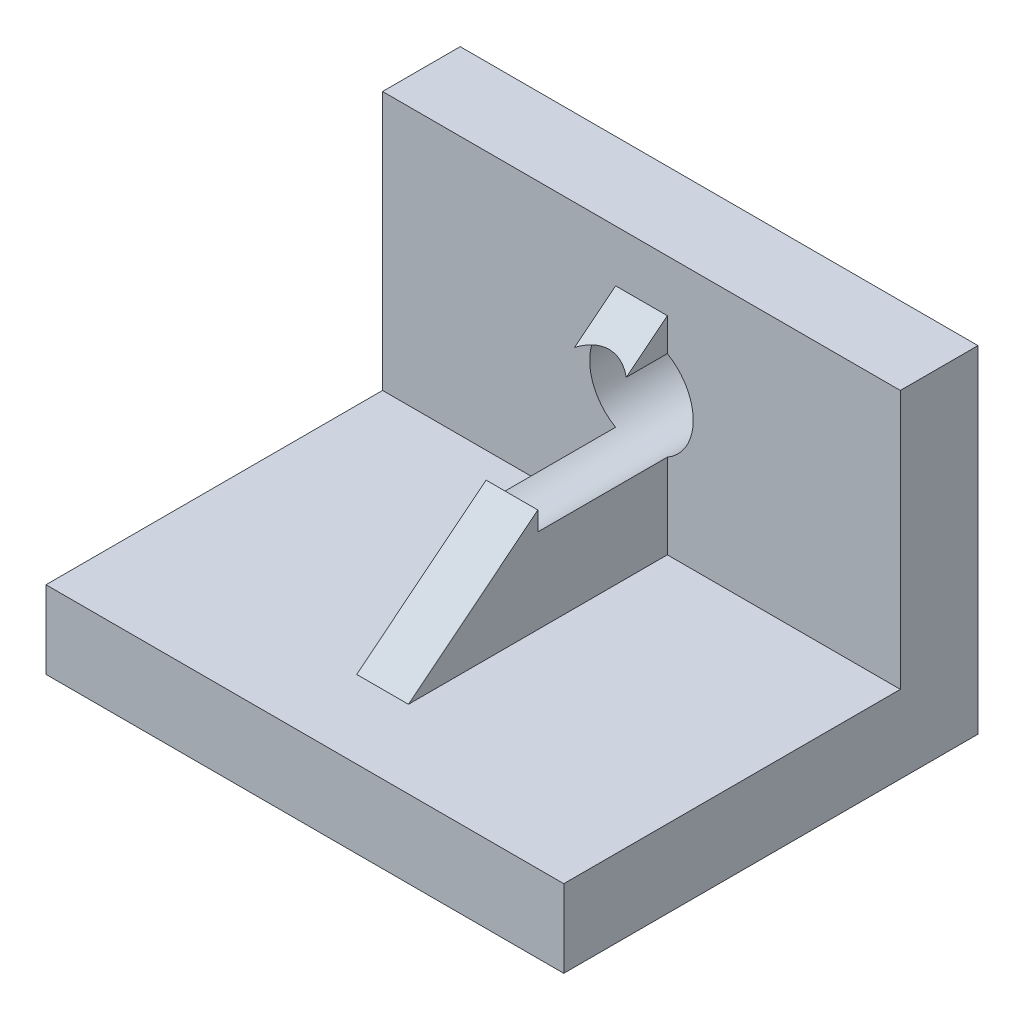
from build123d import *

# Parameters (mm, degrees)
SKETCH_1_W          = 100
SKETCH_1_H          = 80
EXTRUDE_1_DEPTH     = 15
SKETCH_2_W          = 100
SKETCH_2_H          = 15
EXTRUDE_2_DEPTH     = 50
EXTRUDE_3_DEPTH     = 5
SKETCH_4_R          = 10
CUT_EXTRUDE_1_DEPTH = 50


with BuildPart() as part:
    # Sketch 1 → Extrude 1 (new body)
    with BuildSketch(Plane(origin=(0, 0, 0), x_dir=(1, 0, 0), z_dir=(0, 1, 0))):
        Rectangle(SKETCH_1_W, SKETCH_1_H)
    extrude(amount=EXTRUDE_1_DEPTH)

    # Sketch 2 → Extrude 2 (add)
    with BuildSketch(Plane(origin=(0, 15, 0), x_dir=(1, 0, 0), z_dir=(0, 1, 0))):
        with Locations((0, 32.5)):
            Rectangle(SKETCH_2_W, SKETCH_2_H)
    extrude(amount=EXTRUDE_2_DEPTH)

    # Sketch 3 → Extrude 3 (add, symmetric)
    with BuildSketch(Plane(origin=(0, 0, 0), x_dir=(0, 0, -1), z_dir=(1, 0, 0))):
        Polygon((25, 15), (-25, 15), (25, 55), align=None)
    extrude(amount=EXTRUDE_3_DEPTH, both=True)

    # Sketch 4 → Cut-Extrude 1 (cut)
    with BuildSketch(Plane.XY):
        with Locations((0, 40)):
            Circle(SKETCH_4_R)
    extrude(amount=-CUT_EXTRUDE_1_DEPTH, mode=Mode.SUBTRACT)


solid = part.part
